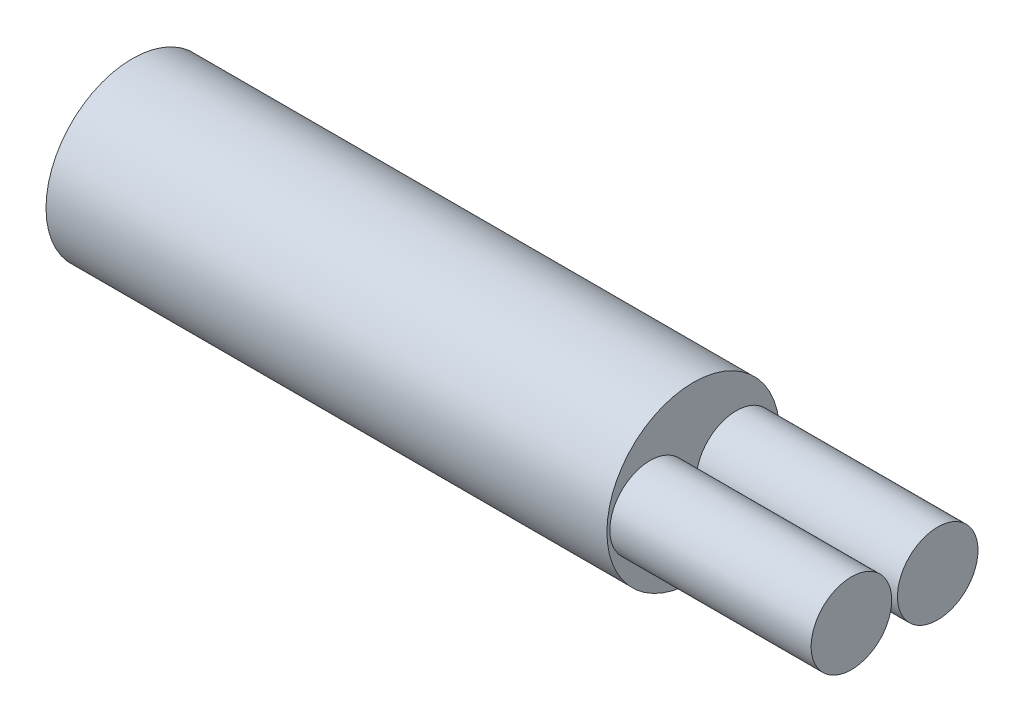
from build123d import *

# Parameters (mm, degrees)
SKIZZE1_R                       = 3
AUFSATZ_LINEAR_AUSTRAGEN1_DEPTH = 19.5
SKIZZE2_R                       = 1.4
AUFSATZ_LINEAR_AUSTRAGEN4_DEPTH = 7


with BuildPart() as part:
    # Skizze1 → Aufsatz-Linear austragen1 (new body)
    with BuildSketch(Plane(origin=(0, 0, 0), x_dir=(0, 0, -1), z_dir=(1, 0, 0))):
        Circle(SKIZZE1_R)
    extrude(amount=-AUFSATZ_LINEAR_AUSTRAGEN1_DEPTH)

    # Skizze2 → Aufsatz-Linear austragen4 (add)
    with BuildSketch(Plane(origin=(0, 0, 0), x_dir=(0, 0, -1), z_dir=(1, 0, 0))):
        with Locations((-1.5, 0)):
            Circle(SKIZZE2_R)
        with Locations((1.5, 0)):
            Circle(SKIZZE2_R)
    extrude(amount=AUFSATZ_LINEAR_AUSTRAGEN4_DEPTH)


solid = part.part
